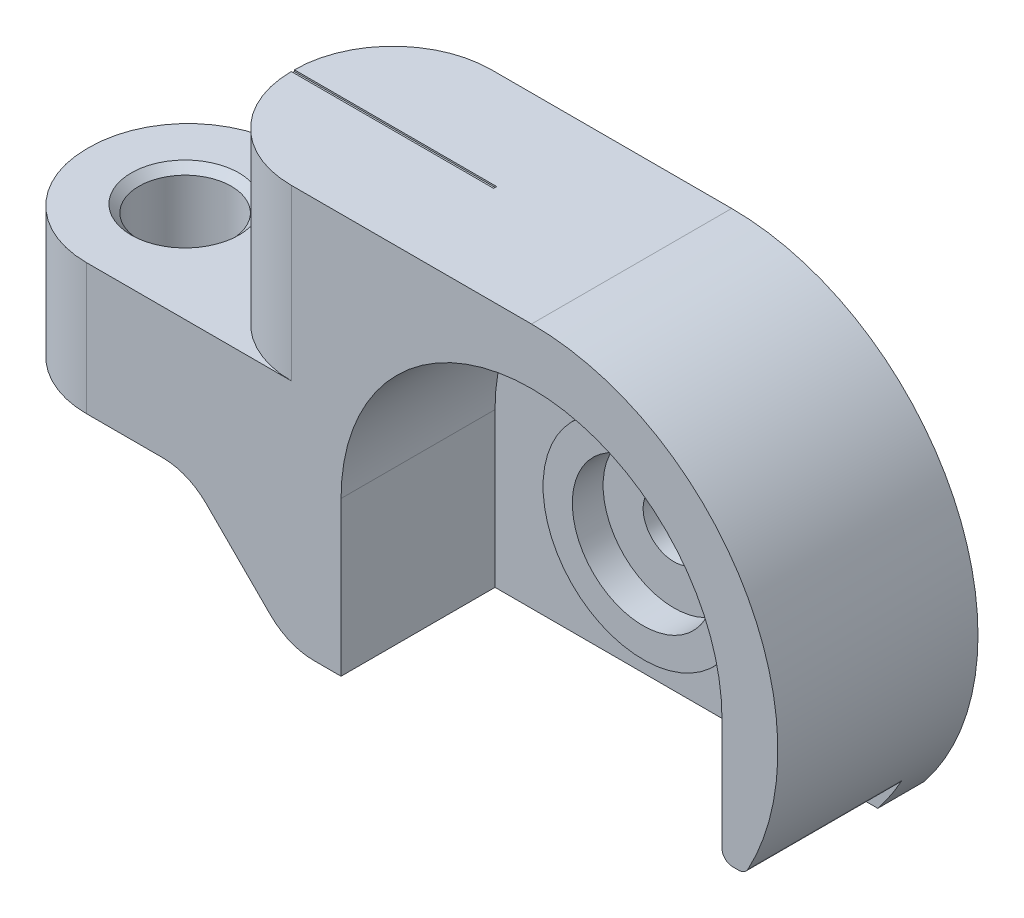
ISO-10303-21;
HEADER;
FILE_DESCRIPTION(('STEP AP214'),'2;1');
FILE_NAME('part.step','',(''),(''),'','','');
FILE_SCHEMA(('AUTOMOTIVE_DESIGN { 1 0 10303 214 1 1 1 1 }'));
ENDSEC;
DATA;
#1=APPLICATION_CONTEXT('core data for automotive mechanical design processes');
#2=APPLICATION_PROTOCOL_DEFINITION('international standard','automotive_design',2000,#1);
#3=PRODUCT_CONTEXT('',#1,'mechanical');
#4=PRODUCT('Part','Part','',(#3));
#5=PRODUCT_RELATED_PRODUCT_CATEGORY('part','',(#4));
#6=PRODUCT_DEFINITION_FORMATION('','',#4);
#7=PRODUCT_DEFINITION_CONTEXT('part definition',#1,'design');
#8=PRODUCT_DEFINITION('design','',#6,#7);
#9=PRODUCT_DEFINITION_SHAPE('','',#8);
#10=(LENGTH_UNIT() NAMED_UNIT(*) SI_UNIT(.MILLI.,.METRE.));
#11=(NAMED_UNIT(*) PLANE_ANGLE_UNIT() SI_UNIT($,.RADIAN.));
#12=(NAMED_UNIT(*) SI_UNIT($,.STERADIAN.) SOLID_ANGLE_UNIT());
#13=UNCERTAINTY_MEASURE_WITH_UNIT(LENGTH_MEASURE(1.E-05),#10,'distance_accuracy_value','');
#14=(GEOMETRIC_REPRESENTATION_CONTEXT(3) GLOBAL_UNCERTAINTY_ASSIGNED_CONTEXT((#13)) GLOBAL_UNIT_ASSIGNED_CONTEXT((#10,
#11,#12)) REPRESENTATION_CONTEXT('',''));
#15=CARTESIAN_POINT('',(0.,0.,0.));
#16=DIRECTION('',(0.,0.,1.));
#17=DIRECTION('',(1.,0.,0.));
#18=AXIS2_PLACEMENT_3D('',#15,#16,#17);
#19=CARTESIAN_POINT('',(-22.,16.,13.));
#20=DIRECTION('',(1.,0.,0.));
#21=DIRECTION('',(0.,1.,0.));
#22=AXIS2_PLACEMENT_3D('',#19,#20,#21);
#23=PLANE('',#22);
#24=DIRECTION('',(0.,0.,1.));
#25=VECTOR('',#24,1.);
#26=CARTESIAN_POINT('',(-22.,15.9,13.));
#27=LINE('',#26,#25);
#28=CARTESIAN_POINT('',(-22.,15.9,6.4));
#29=VERTEX_POINT('',#28);
#30=CARTESIAN_POINT('',(-22.,15.9,6.6));
#31=VERTEX_POINT('',#30);
#32=EDGE_CURVE('E210',#29,#31,#27,.T.);
#33=ORIENTED_EDGE('',*,*,#32,.F.);
#34=DIRECTION('',(0.,-1.,0.));
#35=VECTOR('',#34,1.);
#36=CARTESIAN_POINT('',(-22.,16.,6.4));
#37=LINE('',#36,#35);
#38=CARTESIAN_POINT('',(-22.,5.,6.4));
#39=VERTEX_POINT('',#38);
#40=EDGE_CURVE('E347',#29,#39,#37,.T.);
#41=ORIENTED_EDGE('',*,*,#40,.T.);
#42=DIRECTION('',(0.,0.,-1.));
#43=VECTOR('',#42,1.);
#44=CARTESIAN_POINT('',(-22.,5.,13.));
#45=LINE('',#44,#43);
#46=CARTESIAN_POINT('',(-22.,5.,6.6));
#47=VERTEX_POINT('',#46);
#48=EDGE_CURVE('E297',#47,#39,#45,.T.);
#49=ORIENTED_EDGE('',*,*,#48,.F.);
#50=DIRECTION('',(0.,-1.,0.));
#51=VECTOR('',#50,1.);
#52=CARTESIAN_POINT('',(-22.,16.,6.6));
#53=LINE('',#52,#51);
#54=EDGE_CURVE('E344',#47,#31,#53,.F.);
#55=ORIENTED_EDGE('',*,*,#54,.T.);
#56=EDGE_LOOP('',(#33,#41,#49,#55));
#57=FACE_BOUND('',#56,.T.);
#58=ADVANCED_FACE('F18',(#57),#23,.F.);
#59=CARTESIAN_POINT('',(-15.8,-10.,13.));
#60=DIRECTION('',(0.,1.,0.));
#61=DIRECTION('',(0.,0.,1.));
#62=AXIS2_PLACEMENT_3D('',#59,#60,#61);
#63=PLANE('',#62);
#64=DIRECTION('',(1.,0.,0.));
#65=VECTOR('',#64,1.);
#66=CARTESIAN_POINT('',(-15.8,-10.,13.));
#67=LINE('',#66,#65);
#68=CARTESIAN_POINT('',(-14.1431457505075,-10.,13.));
#69=VERTEX_POINT('',#68);
#70=CARTESIAN_POINT('',(-12.3698713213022,-10.,13.));
#71=VERTEX_POINT('',#70);
#72=EDGE_CURVE('E274',#69,#71,#67,.T.);
#73=ORIENTED_EDGE('',*,*,#72,.F.);
#74=DIRECTION('',(0.,0.,-1.));
#75=VECTOR('',#74,1.);
#76=CARTESIAN_POINT('',(-14.1431457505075,-10.,13.));
#77=LINE('',#76,#75);
#78=CARTESIAN_POINT('',(-14.1431457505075,-10.,0.));
#79=VERTEX_POINT('',#78);
#80=EDGE_CURVE('E331',#69,#79,#77,.T.);
#81=ORIENTED_EDGE('',*,*,#80,.T.);
#82=DIRECTION('',(1.,0.,0.));
#83=VECTOR('',#82,1.);
#84=CARTESIAN_POINT('',(-15.8,-10.,0.));
#85=LINE('',#84,#83);
#86=CARTESIAN_POINT('',(12.4899959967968,-10.,0.));
#87=VERTEX_POINT('',#86);
#88=EDGE_CURVE('E263',#79,#87,#85,.T.);
#89=ORIENTED_EDGE('',*,*,#88,.T.);
#90=DIRECTION('',(0.,0.,-1.));
#91=VECTOR('',#90,1.);
#92=CARTESIAN_POINT('',(12.4899959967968,-10.,13.));
#93=LINE('',#92,#91);
#94=CARTESIAN_POINT('',(12.4899959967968,-10.,3.));
#95=VERTEX_POINT('',#94);
#96=EDGE_CURVE('E276',#95,#87,#93,.T.);
#97=ORIENTED_EDGE('',*,*,#96,.F.);
#98=DIRECTION('',(1.,0.,0.));
#99=VECTOR('',#98,1.);
#100=CARTESIAN_POINT('',(-12.3698713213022,-10.,3.));
#101=LINE('',#100,#99);
#102=CARTESIAN_POINT('',(-12.3698713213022,-10.,3.));
#103=VERTEX_POINT('',#102);
#104=EDGE_CURVE('E241',#103,#95,#101,.T.);
#105=ORIENTED_EDGE('',*,*,#104,.F.);
#106=DIRECTION('',(0.,0.,1.));
#107=VECTOR('',#106,1.);
#108=CARTESIAN_POINT('',(-12.3698713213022,-10.,3.));
#109=LINE('',#108,#107);
#110=EDGE_CURVE('E256',#103,#71,#109,.T.);
#111=ORIENTED_EDGE('',*,*,#110,.T.);
#112=EDGE_LOOP('',(#73,#81,#89,#97,#105,#111));
#113=FACE_BOUND('',#112,.T.);
#114=ADVANCED_FACE('F410',(#113),#63,.F.);
#115=CARTESIAN_POINT('',(0.,0.,13.));
#116=DIRECTION('',(0.,0.,-1.));
#117=DIRECTION('',(-1.,0.,0.));
#118=AXIS2_PLACEMENT_3D('',#115,#116,#117);
#119=CYLINDRICAL_SURFACE('',#118,2.);
#120=CARTESIAN_POINT('',(0.,0.,2.5));
#121=DIRECTION('',(0.,0.,1.));
#122=DIRECTION('',(1.,0.,0.));
#123=AXIS2_PLACEMENT_3D('',#120,#121,#122);
#124=CIRCLE('',#123,2.);
#125=CARTESIAN_POINT('',(2.,0.,2.5));
#126=VERTEX_POINT('',#125);
#127=EDGE_CURVE('E11',#126,#126,#124,.F.);
#128=ORIENTED_EDGE('',*,*,#127,.T.);
#129=EDGE_LOOP('',(#128));
#130=FACE_BOUND('',#129,.T.);
#131=CARTESIAN_POINT('',(0.,0.,3.75));
#132=DIRECTION('',(0.,0.,1.));
#133=DIRECTION('',(1.,0.,0.));
#134=AXIS2_PLACEMENT_3D('',#131,#132,#133);
#135=CIRCLE('',#134,2.);
#136=CARTESIAN_POINT('',(2.,0.,3.75));
#137=VERTEX_POINT('',#136);
#138=EDGE_CURVE('E225',#137,#137,#135,.T.);
#139=ORIENTED_EDGE('',*,*,#138,.T.);
#140=EDGE_LOOP('',(#139));
#141=FACE_BOUND('',#140,.T.);
#142=ADVANCED_FACE('F417',(#130,#141),#119,.F.);
#143=CARTESIAN_POINT('',(0.,0.,13.));
#144=DIRECTION('',(0.,0.,1.));
#145=DIRECTION('',(1.,0.,0.));
#146=AXIS2_PLACEMENT_3D('',#143,#144,#145);
#147=PLANE('',#146);
#148=DIRECTION('',(-1.,0.,0.));
#149=VECTOR('',#148,1.);
#150=CARTESIAN_POINT('',(0.,16.,13.));
#151=LINE('',#150,#149);
#152=CARTESIAN_POINT('',(0.,16.,13.));
#153=VERTEX_POINT('',#152);
#154=CARTESIAN_POINT('',(-15.6,16.,13.));
#155=VERTEX_POINT('',#154);
#156=EDGE_CURVE('E262',#153,#155,#151,.T.);
#157=ORIENTED_EDGE('',*,*,#156,.T.);
#158=DIRECTION('',(0.,-1.,0.));
#159=VECTOR('',#158,1.);
#160=CARTESIAN_POINT('',(-15.6,5.,13.));
#161=LINE('',#160,#159);
#162=CARTESIAN_POINT('',(-15.6,5.,13.));
#163=VERTEX_POINT('',#162);
#164=EDGE_CURVE('E361',#155,#163,#161,.T.);
#165=ORIENTED_EDGE('',*,*,#164,.T.);
#166=DIRECTION('',(-1.,0.,0.));
#167=VECTOR('',#166,1.);
#168=CARTESIAN_POINT('',(-22.,5.,13.));
#169=LINE('',#168,#167);
#170=CARTESIAN_POINT('',(-28.9,5.,13.));
#171=VERTEX_POINT('',#170);
#172=EDGE_CURVE('E266',#163,#171,#169,.T.);
#173=ORIENTED_EDGE('',*,*,#172,.T.);
#174=DIRECTION('',(0.,-1.,0.));
#175=VECTOR('',#174,1.);
#176=CARTESIAN_POINT('',(-28.9,-3.5,13.));
#177=LINE('',#176,#175);
#178=CARTESIAN_POINT('',(-28.9,-3.5,13.));
#179=VERTEX_POINT('',#178);
#180=EDGE_CURVE('E358',#171,#179,#177,.T.);
#181=ORIENTED_EDGE('',*,*,#180,.T.);
#182=DIRECTION('',(1.,0.,0.));
#183=VECTOR('',#182,1.);
#184=CARTESIAN_POINT('',(-35.3,-3.5,13.));
#185=LINE('',#184,#183);
#186=CARTESIAN_POINT('',(-23.9568542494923,-3.5,13.));
#187=VERTEX_POINT('',#186);
#188=EDGE_CURVE('E269',#179,#187,#185,.T.);
#189=ORIENTED_EDGE('',*,*,#188,.T.);
#190=CARTESIAN_POINT('',(-23.9568542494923,-7.5,13.));
#191=DIRECTION('',(0.,0.,1.));
#192=DIRECTION('',(1.,0.,0.));
#193=AXIS2_PLACEMENT_3D('',#190,#191,#192);
#194=CIRCLE('',#193,4.);
#195=CARTESIAN_POINT('',(-21.1284271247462,-4.67157287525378,13.));
#196=VERTEX_POINT('',#195);
#197=EDGE_CURVE('E341',#187,#196,#194,.F.);
#198=ORIENTED_EDGE('',*,*,#197,.T.);
#199=DIRECTION('',(0.707106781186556,-0.707106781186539,0.));
#200=VECTOR('',#199,1.);
#201=CARTESIAN_POINT('',(-22.3,-3.5,13.));
#202=LINE('',#201,#200);
#203=CARTESIAN_POINT('',(-16.9715728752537,-8.82842712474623,13.));
#204=VERTEX_POINT('',#203);
#205=EDGE_CURVE('E271',#196,#204,#202,.T.);
#206=ORIENTED_EDGE('',*,*,#205,.T.);
#207=CARTESIAN_POINT('',(-14.1431457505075,-6.,13.));
#208=DIRECTION('',(0.,0.,1.));
#209=DIRECTION('',(1.,0.,0.));
#210=AXIS2_PLACEMENT_3D('',#207,#208,#209);
#211=CIRCLE('',#210,4.);
#212=EDGE_CURVE('E336',#204,#69,#211,.T.);
#213=ORIENTED_EDGE('',*,*,#212,.T.);
#214=ORIENTED_EDGE('',*,*,#72,.T.);
#215=DIRECTION('',(0.,-1.,0.));
#216=VECTOR('',#215,1.);
#217=CARTESIAN_POINT('',(-12.3698713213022,0.,13.));
#218=LINE('',#217,#216);
#219=CARTESIAN_POINT('',(-12.3698713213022,0.,13.));
#220=VERTEX_POINT('',#219);
#221=EDGE_CURVE('E248',#220,#71,#218,.T.);
#222=ORIENTED_EDGE('',*,*,#221,.F.);
#223=CARTESIAN_POINT('',(0.,0.,13.));
#224=DIRECTION('',(0.,0.,1.));
#225=DIRECTION('',(1.,0.,0.));
#226=AXIS2_PLACEMENT_3D('',#223,#224,#225);
#227=CIRCLE('',#226,12.3698713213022);
#228=CARTESIAN_POINT('',(12.3698713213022,0.,13.));
#229=VERTEX_POINT('',#228);
#230=EDGE_CURVE('E231',#229,#220,#227,.T.);
#231=ORIENTED_EDGE('',*,*,#230,.F.);
#232=DIRECTION('',(0.,1.,0.));
#233=VECTOR('',#232,1.);
#234=CARTESIAN_POINT('',(12.3698713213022,0.,13.));
#235=LINE('',#234,#233);
#236=CARTESIAN_POINT('',(12.3698713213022,-7.3,13.));
#237=VERTEX_POINT('',#236);
#238=EDGE_CURVE('E239',#237,#229,#235,.T.);
#239=ORIENTED_EDGE('',*,*,#238,.F.);
#240=CARTESIAN_POINT('',(13.0698713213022,-7.3,13.));
#241=DIRECTION('',(0.,0.,1.));
#242=DIRECTION('',(1.,0.,0.));
#243=AXIS2_PLACEMENT_3D('',#240,#241,#242);
#244=CIRCLE('',#243,0.7);
#245=CARTESIAN_POINT('',(13.0698713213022,-8.,13.));
#246=VERTEX_POINT('',#245);
#247=EDGE_CURVE('E312',#237,#246,#244,.T.);
#248=ORIENTED_EDGE('',*,*,#247,.T.);
#249=DIRECTION('',(-1.,0.,0.));
#250=VECTOR('',#249,1.);
#251=CARTESIAN_POINT('',(9.20101607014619,-8.,13.));
#252=LINE('',#251,#250);
#253=CARTESIAN_POINT('',(13.4461890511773,-8.,13.));
#254=VERTEX_POINT('',#253);
#255=EDGE_CURVE('E213',#254,#246,#252,.T.);
#256=ORIENTED_EDGE('',*,*,#255,.F.);
#257=CARTESIAN_POINT('',(13.4461890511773,-7.3,13.));
#258=DIRECTION('',(0.,0.,1.));
#259=DIRECTION('',(1.,0.,0.));
#260=AXIS2_PLACEMENT_3D('',#257,#258,#259);
#261=CIRCLE('',#260,0.7);
#262=CARTESIAN_POINT('',(14.0613741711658,-7.63398692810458,13.));
#263=VERTEX_POINT('',#262);
#264=EDGE_CURVE('E314',#254,#263,#261,.T.);
#265=ORIENTED_EDGE('',*,*,#264,.T.);
#266=CARTESIAN_POINT('',(0.,0.,13.));
#267=DIRECTION('',(0.,0.,1.));
#268=DIRECTION('',(1.,0.,0.));
#269=AXIS2_PLACEMENT_3D('',#266,#267,#268);
#270=CIRCLE('',#269,16.);
#271=EDGE_CURVE('E260',#263,#153,#270,.T.);
#272=ORIENTED_EDGE('',*,*,#271,.T.);
#273=EDGE_LOOP('',(#157,#165,#173,#181,#189,#198,#206,#213,#214,#222,#231,#239,#248,#256,#265,#272));
#274=FACE_BOUND('',#273,.T.);
#275=ADVANCED_FACE('F528',(#274),#147,.T.);
#276=CARTESIAN_POINT('',(0.,0.,0.));
#277=DIRECTION('',(0.,0.,1.));
#278=DIRECTION('',(1.,0.,0.));
#279=AXIS2_PLACEMENT_3D('',#276,#277,#278);
#280=PLANE('',#279);
#281=CARTESIAN_POINT('',(0.,0.,0.));
#282=DIRECTION('',(0.,0.,1.));
#283=DIRECTION('',(1.,0.,0.));
#284=AXIS2_PLACEMENT_3D('',#281,#282,#283);
#285=CIRCLE('',#284,4.5);
#286=CARTESIAN_POINT('',(4.5,0.,0.));
#287=VERTEX_POINT('',#286);
#288=EDGE_CURVE('E26',#287,#287,#285,.T.);
#289=ORIENTED_EDGE('',*,*,#288,.T.);
#290=EDGE_LOOP('',(#289));
#291=FACE_BOUND('',#290,.T.);
#292=DIRECTION('',(-1.,0.,0.));
#293=VECTOR('',#292,1.);
#294=CARTESIAN_POINT('',(-22.,5.,0.));
#295=LINE('',#294,#293);
#296=CARTESIAN_POINT('',(-15.6,5.,0.));
#297=VERTEX_POINT('',#296);
#298=CARTESIAN_POINT('',(-28.9,5.,0.));
#299=VERTEX_POINT('',#298);
#300=EDGE_CURVE('E282',#297,#299,#295,.T.);
#301=ORIENTED_EDGE('',*,*,#300,.F.);
#302=DIRECTION('',(0.,-1.,0.));
#303=VECTOR('',#302,1.);
#304=CARTESIAN_POINT('',(-15.6,0.,0.));
#305=LINE('',#304,#303);
#306=CARTESIAN_POINT('',(-15.6,16.,0.));
#307=VERTEX_POINT('',#306);
#308=EDGE_CURVE('E351',#297,#307,#305,.F.);
#309=ORIENTED_EDGE('',*,*,#308,.T.);
#310=DIRECTION('',(-1.,0.,0.));
#311=VECTOR('',#310,1.);
#312=CARTESIAN_POINT('',(0.,16.,0.));
#313=LINE('',#312,#311);
#314=CARTESIAN_POINT('',(0.,16.,0.));
#315=VERTEX_POINT('',#314);
#316=EDGE_CURVE('E279',#315,#307,#313,.T.);
#317=ORIENTED_EDGE('',*,*,#316,.F.);
#318=CARTESIAN_POINT('',(0.,0.,0.));
#319=DIRECTION('',(0.,0.,1.));
#320=DIRECTION('',(1.,0.,0.));
#321=AXIS2_PLACEMENT_3D('',#318,#319,#320);
#322=CIRCLE('',#321,16.);
#323=EDGE_CURVE('E255',#87,#315,#322,.T.);
#324=ORIENTED_EDGE('',*,*,#323,.F.);
#325=ORIENTED_EDGE('',*,*,#88,.F.);
#326=CARTESIAN_POINT('',(-14.1431457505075,-6.,0.));
#327=DIRECTION('',(0.,0.,1.));
#328=DIRECTION('',(1.,0.,0.));
#329=AXIS2_PLACEMENT_3D('',#326,#327,#328);
#330=CIRCLE('',#329,4.);
#331=CARTESIAN_POINT('',(-16.9715728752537,-8.82842712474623,0.));
#332=VERTEX_POINT('',#331);
#333=EDGE_CURVE('E334',#79,#332,#330,.F.);
#334=ORIENTED_EDGE('',*,*,#333,.T.);
#335=DIRECTION('',(0.707106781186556,-0.707106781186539,0.));
#336=VECTOR('',#335,1.);
#337=CARTESIAN_POINT('',(-22.3,-3.5,0.));
#338=LINE('',#337,#336);
#339=CARTESIAN_POINT('',(-21.1284271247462,-4.67157287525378,0.));
#340=VERTEX_POINT('',#339);
#341=EDGE_CURVE('E286',#340,#332,#338,.T.);
#342=ORIENTED_EDGE('',*,*,#341,.F.);
#343=CARTESIAN_POINT('',(-23.9568542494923,-7.5,0.));
#344=DIRECTION('',(0.,0.,1.));
#345=DIRECTION('',(1.,0.,0.));
#346=AXIS2_PLACEMENT_3D('',#343,#344,#345);
#347=CIRCLE('',#346,4.);
#348=CARTESIAN_POINT('',(-23.9568542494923,-3.5,0.));
#349=VERTEX_POINT('',#348);
#350=EDGE_CURVE('E338',#340,#349,#347,.T.);
#351=ORIENTED_EDGE('',*,*,#350,.T.);
#352=DIRECTION('',(1.,0.,0.));
#353=VECTOR('',#352,1.);
#354=CARTESIAN_POINT('',(-35.3,-3.5,0.));
#355=LINE('',#354,#353);
#356=CARTESIAN_POINT('',(-28.9,-3.5,0.));
#357=VERTEX_POINT('',#356);
#358=EDGE_CURVE('E284',#357,#349,#355,.T.);
#359=ORIENTED_EDGE('',*,*,#358,.F.);
#360=DIRECTION('',(0.,-1.,0.));
#361=VECTOR('',#360,1.);
#362=CARTESIAN_POINT('',(-28.9,0.,0.));
#363=LINE('',#362,#361);
#364=EDGE_CURVE('E349',#357,#299,#363,.F.);
#365=ORIENTED_EDGE('',*,*,#364,.T.);
#366=EDGE_LOOP('',(#301,#309,#317,#324,#325,#334,#342,#351,#359,#365));
#367=FACE_BOUND('',#366,.T.);
#368=ADVANCED_FACE('F395',(#291,#367),#280,.F.);
#369=CARTESIAN_POINT('',(0.,0.,13.));
#370=DIRECTION('',(0.,0.,-1.));
#371=DIRECTION('',(-1.,0.,0.));
#372=AXIS2_PLACEMENT_3D('',#369,#370,#371);
#373=CYLINDRICAL_SURFACE('',#372,16.);
#374=ORIENTED_EDGE('',*,*,#271,.F.);
#375=DIRECTION('',(0.,0.,-1.));
#376=VECTOR('',#375,1.);
#377=CARTESIAN_POINT('',(14.0613741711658,-7.63398692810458,13.));
#378=LINE('',#377,#376);
#379=CARTESIAN_POINT('',(14.0613741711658,-7.63398692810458,3.));
#380=VERTEX_POINT('',#379);
#381=EDGE_CURVE('E303',#263,#380,#378,.T.);
#382=ORIENTED_EDGE('',*,*,#381,.T.);
#383=CARTESIAN_POINT('',(0.,0.,3.));
#384=DIRECTION('',(0.,0.,1.));
#385=DIRECTION('',(1.,0.,0.));
#386=AXIS2_PLACEMENT_3D('',#383,#384,#385);
#387=CIRCLE('',#386,16.);
#388=EDGE_CURVE('E217',#95,#380,#387,.T.);
#389=ORIENTED_EDGE('',*,*,#388,.F.);
#390=ORIENTED_EDGE('',*,*,#96,.T.);
#391=ORIENTED_EDGE('',*,*,#323,.T.);
#392=DIRECTION('',(0.,0.,-1.));
#393=VECTOR('',#392,1.);
#394=CARTESIAN_POINT('',(0.,16.,13.));
#395=LINE('',#394,#393);
#396=EDGE_CURVE('E300',#153,#315,#395,.T.);
#397=ORIENTED_EDGE('',*,*,#396,.F.);
#398=EDGE_LOOP('',(#374,#382,#389,#390,#391,#397));
#399=FACE_BOUND('',#398,.T.);
#400=ADVANCED_FACE('F427',(#399),#373,.T.);
#401=CARTESIAN_POINT('',(0.,16.,13.));
#402=DIRECTION('',(0.,-1.,0.));
#403=DIRECTION('',(1.,0.,0.));
#404=AXIS2_PLACEMENT_3D('',#401,#402,#403);
#405=PLANE('',#404);
#406=DIRECTION('',(0.,0.,-1.));
#407=VECTOR('',#406,1.);
#408=CARTESIAN_POINT('',(-8.85759189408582,16.,6.4));
#409=LINE('',#408,#407);
#410=CARTESIAN_POINT('',(-8.85759189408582,16.,6.6));
#411=VERTEX_POINT('',#410);
#412=CARTESIAN_POINT('',(-8.85759189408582,16.,6.4));
#413=VERTEX_POINT('',#412);
#414=EDGE_CURVE('E188',#411,#413,#409,.T.);
#415=ORIENTED_EDGE('',*,*,#414,.F.);
#416=DIRECTION('',(1.,0.,0.));
#417=VECTOR('',#416,1.);
#418=CARTESIAN_POINT('',(-23.9290935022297,16.,6.6));
#419=LINE('',#418,#417);
#420=CARTESIAN_POINT('',(-22.,16.,6.6));
#421=VERTEX_POINT('',#420);
#422=EDGE_CURVE('E202',#421,#411,#419,.T.);
#423=ORIENTED_EDGE('',*,*,#422,.F.);
#424=CARTESIAN_POINT('',(-15.6,16.,6.6));
#425=DIRECTION('',(0.,-1.,0.));
#426=DIRECTION('',(1.,0.,0.));
#427=AXIS2_PLACEMENT_3D('',#424,#425,#426);
#428=CIRCLE('',#427,6.4);
#429=EDGE_CURVE('E353',#421,#155,#428,.F.);
#430=ORIENTED_EDGE('',*,*,#429,.T.);
#431=ORIENTED_EDGE('',*,*,#156,.F.);
#432=ORIENTED_EDGE('',*,*,#396,.T.);
#433=ORIENTED_EDGE('',*,*,#316,.T.);
#434=CARTESIAN_POINT('',(-15.6,16.,6.4));
#435=DIRECTION('',(0.,-1.,0.));
#436=DIRECTION('',(1.,0.,0.));
#437=AXIS2_PLACEMENT_3D('',#434,#435,#436);
#438=CIRCLE('',#437,6.4);
#439=CARTESIAN_POINT('',(-22.,16.,6.4));
#440=VERTEX_POINT('',#439);
#441=EDGE_CURVE('E355',#307,#440,#438,.F.);
#442=ORIENTED_EDGE('',*,*,#441,.T.);
#443=DIRECTION('',(-1.,0.,0.));
#444=VECTOR('',#443,1.);
#445=CARTESIAN_POINT('',(-23.9290935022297,16.,6.4));
#446=LINE('',#445,#444);
#447=EDGE_CURVE('E204',#413,#440,#446,.T.);
#448=ORIENTED_EDGE('',*,*,#447,.F.);
#449=EDGE_LOOP('',(#415,#423,#430,#431,#432,#433,#442,#448));
#450=FACE_BOUND('',#449,.T.);
#451=ADVANCED_FACE('F424',(#450),#405,.F.);
#452=CARTESIAN_POINT('',(-22.,5.,13.));
#453=DIRECTION('',(0.,-1.,0.));
#454=DIRECTION('',(1.,0.,0.));
#455=AXIS2_PLACEMENT_3D('',#452,#453,#454);
#456=PLANE('',#455);
#457=CARTESIAN_POINT('',(-29.,5.,6.5));
#458=DIRECTION('',(0.,-1.,0.));
#459=DIRECTION('',(1.,0.,0.));
#460=AXIS2_PLACEMENT_3D('',#457,#458,#459);
#461=CIRCLE('',#460,3.5);
#462=CARTESIAN_POINT('',(-25.5,5.,6.5));
#463=VERTEX_POINT('',#462);
#464=EDGE_CURVE('E390',#463,#463,#461,.T.);
#465=ORIENTED_EDGE('',*,*,#464,.T.);
#466=EDGE_LOOP('',(#465));
#467=FACE_BOUND('',#466,.T.);
#468=ORIENTED_EDGE('',*,*,#300,.T.);
#469=CARTESIAN_POINT('',(-28.9,5.,6.4));
#470=DIRECTION('',(0.,-1.,0.));
#471=DIRECTION('',(1.,0.,0.));
#472=AXIS2_PLACEMENT_3D('',#469,#470,#471);
#473=CIRCLE('',#472,6.4);
#474=CARTESIAN_POINT('',(-35.3,5.,6.4));
#475=VERTEX_POINT('',#474);
#476=EDGE_CURVE('E41',#299,#475,#473,.F.);
#477=ORIENTED_EDGE('',*,*,#476,.T.);
#478=DIRECTION('',(0.,0.,-1.));
#479=VECTOR('',#478,1.);
#480=CARTESIAN_POINT('',(-35.3,5.,13.));
#481=LINE('',#480,#479);
#482=CARTESIAN_POINT('',(-35.3,5.,6.6));
#483=VERTEX_POINT('',#482);
#484=EDGE_CURVE('E295',#483,#475,#481,.T.);
#485=ORIENTED_EDGE('',*,*,#484,.F.);
#486=CARTESIAN_POINT('',(-28.9,5.,6.6));
#487=DIRECTION('',(0.,-1.,0.));
#488=DIRECTION('',(1.,0.,0.));
#489=AXIS2_PLACEMENT_3D('',#486,#487,#488);
#490=CIRCLE('',#489,6.4);
#491=EDGE_CURVE('E373',#483,#171,#490,.F.);
#492=ORIENTED_EDGE('',*,*,#491,.T.);
#493=ORIENTED_EDGE('',*,*,#172,.F.);
#494=CARTESIAN_POINT('',(-15.6,5.,6.6));
#495=DIRECTION('',(0.,-1.,0.));
#496=DIRECTION('',(1.,0.,0.));
#497=AXIS2_PLACEMENT_3D('',#494,#495,#496);
#498=CIRCLE('',#497,6.4);
#499=EDGE_CURVE('E379',#163,#47,#498,.T.);
#500=ORIENTED_EDGE('',*,*,#499,.T.);
#501=ORIENTED_EDGE('',*,*,#48,.T.);
#502=CARTESIAN_POINT('',(-15.6,5.,6.4));
#503=DIRECTION('',(0.,-1.,0.));
#504=DIRECTION('',(1.,0.,0.));
#505=AXIS2_PLACEMENT_3D('',#502,#503,#504);
#506=CIRCLE('',#505,6.4);
#507=EDGE_CURVE('E376',#39,#297,#506,.T.);
#508=ORIENTED_EDGE('',*,*,#507,.T.);
#509=EDGE_LOOP('',(#468,#477,#485,#492,#493,#500,#501,#508));
#510=FACE_BOUND('',#509,.T.);
#511=ADVANCED_FACE('F422',(#467,#510),#456,.F.);
#512=CARTESIAN_POINT('',(-35.3,5.,13.));
#513=DIRECTION('',(1.,0.,0.));
#514=DIRECTION('',(0.,0.,-1.));
#515=AXIS2_PLACEMENT_3D('',#512,#513,#514);
#516=PLANE('',#515);
#517=ORIENTED_EDGE('',*,*,#484,.T.);
#518=DIRECTION('',(0.,-1.,0.));
#519=VECTOR('',#518,1.);
#520=CARTESIAN_POINT('',(-35.3,5.,6.4));
#521=LINE('',#520,#519);
#522=CARTESIAN_POINT('',(-35.3,-3.5,6.4));
#523=VERTEX_POINT('',#522);
#524=EDGE_CURVE('E366',#475,#523,#521,.T.);
#525=ORIENTED_EDGE('',*,*,#524,.T.);
#526=DIRECTION('',(0.,0.,-1.));
#527=VECTOR('',#526,1.);
#528=CARTESIAN_POINT('',(-35.3,-3.5,13.));
#529=LINE('',#528,#527);
#530=CARTESIAN_POINT('',(-35.3,-3.5,6.6));
#531=VERTEX_POINT('',#530);
#532=EDGE_CURVE('E292',#531,#523,#529,.T.);
#533=ORIENTED_EDGE('',*,*,#532,.F.);
#534=DIRECTION('',(0.,-1.,0.));
#535=VECTOR('',#534,1.);
#536=CARTESIAN_POINT('',(-35.3,5.,6.6));
#537=LINE('',#536,#535);
#538=EDGE_CURVE('E364',#531,#483,#537,.F.);
#539=ORIENTED_EDGE('',*,*,#538,.T.);
#540=EDGE_LOOP('',(#517,#525,#533,#539));
#541=FACE_BOUND('',#540,.T.);
#542=ADVANCED_FACE('F540',(#541),#516,.F.);
#543=CARTESIAN_POINT('',(-35.3,-3.5,13.));
#544=DIRECTION('',(0.,1.,0.));
#545=DIRECTION('',(-1.,0.,0.));
#546=AXIS2_PLACEMENT_3D('',#543,#544,#545);
#547=PLANE('',#546);
#548=CARTESIAN_POINT('',(-29.,-3.5,6.5));
#549=DIRECTION('',(0.,1.,0.));
#550=DIRECTION('',(-1.,0.,0.));
#551=AXIS2_PLACEMENT_3D('',#548,#549,#550);
#552=CIRCLE('',#551,3.5);
#553=CARTESIAN_POINT('',(-32.5,-3.5,6.5));
#554=VERTEX_POINT('',#553);
#555=EDGE_CURVE('E381',#554,#554,#552,.T.);
#556=ORIENTED_EDGE('',*,*,#555,.T.);
#557=EDGE_LOOP('',(#556));
#558=FACE_BOUND('',#557,.T.);
#559=ORIENTED_EDGE('',*,*,#532,.T.);
#560=CARTESIAN_POINT('',(-28.9,-3.5,6.4));
#561=DIRECTION('',(0.,1.,0.));
#562=DIRECTION('',(-1.,0.,0.));
#563=AXIS2_PLACEMENT_3D('',#560,#561,#562);
#564=CIRCLE('',#563,6.4);
#565=EDGE_CURVE('E371',#523,#357,#564,.F.);
#566=ORIENTED_EDGE('',*,*,#565,.T.);
#567=ORIENTED_EDGE('',*,*,#358,.T.);
#568=DIRECTION('',(0.,0.,-1.));
#569=VECTOR('',#568,1.);
#570=CARTESIAN_POINT('',(-23.9568542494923,-3.5,13.));
#571=LINE('',#570,#569);
#572=EDGE_CURVE('E328',#349,#187,#571,.F.);
#573=ORIENTED_EDGE('',*,*,#572,.T.);
#574=ORIENTED_EDGE('',*,*,#188,.F.);
#575=CARTESIAN_POINT('',(-28.9,-3.5,6.6));
#576=DIRECTION('',(0.,1.,0.));
#577=DIRECTION('',(-1.,0.,0.));
#578=AXIS2_PLACEMENT_3D('',#575,#576,#577);
#579=CIRCLE('',#578,6.4);
#580=EDGE_CURVE('E369',#179,#531,#579,.F.);
#581=ORIENTED_EDGE('',*,*,#580,.T.);
#582=EDGE_LOOP('',(#559,#566,#567,#573,#574,#581));
#583=FACE_BOUND('',#582,.T.);
#584=ADVANCED_FACE('F537',(#558,#583),#547,.F.);
#585=CARTESIAN_POINT('',(-22.3,-3.5,13.));
#586=DIRECTION('',(0.707106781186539,0.707106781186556,0.));
#587=DIRECTION('',(-0.707106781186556,0.707106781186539,0.));
#588=AXIS2_PLACEMENT_3D('',#585,#586,#587);
#589=PLANE('',#588);
#590=ORIENTED_EDGE('',*,*,#205,.F.);
#591=DIRECTION('',(0.,0.,-1.));
#592=VECTOR('',#591,1.);
#593=CARTESIAN_POINT('',(-21.1284271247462,-4.67157287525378,0.));
#594=LINE('',#593,#592);
#595=EDGE_CURVE('E325',#196,#340,#594,.T.);
#596=ORIENTED_EDGE('',*,*,#595,.T.);
#597=ORIENTED_EDGE('',*,*,#341,.T.);
#598=DIRECTION('',(0.,0.,-1.));
#599=VECTOR('',#598,1.);
#600=CARTESIAN_POINT('',(-16.9715728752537,-8.82842712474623,13.));
#601=LINE('',#600,#599);
#602=EDGE_CURVE('E323',#332,#204,#601,.F.);
#603=ORIENTED_EDGE('',*,*,#602,.T.);
#604=EDGE_LOOP('',(#590,#596,#597,#603));
#605=FACE_BOUND('',#604,.T.);
#606=ADVANCED_FACE('F524',(#605),#589,.F.);
#607=CARTESIAN_POINT('',(0.,0.,3.));
#608=DIRECTION('',(0.,0.,1.));
#609=DIRECTION('',(1.,0.,0.));
#610=AXIS2_PLACEMENT_3D('',#607,#608,#609);
#611=CYLINDRICAL_SURFACE('',#610,12.3698713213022);
#612=ORIENTED_EDGE('',*,*,#230,.T.);
#613=DIRECTION('',(0.,0.,1.));
#614=VECTOR('',#613,1.);
#615=CARTESIAN_POINT('',(-12.3698713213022,0.,3.));
#616=LINE('',#615,#614);
#617=CARTESIAN_POINT('',(-12.3698713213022,0.,3.));
#618=VERTEX_POINT('',#617);
#619=EDGE_CURVE('E245',#618,#220,#616,.T.);
#620=ORIENTED_EDGE('',*,*,#619,.F.);
#621=CARTESIAN_POINT('',(0.,0.,3.));
#622=DIRECTION('',(0.,0.,1.));
#623=DIRECTION('',(1.,0.,0.));
#624=AXIS2_PLACEMENT_3D('',#621,#622,#623);
#625=CIRCLE('',#624,12.3698713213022);
#626=CARTESIAN_POINT('',(12.3698713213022,0.,3.));
#627=VERTEX_POINT('',#626);
#628=EDGE_CURVE('E235',#627,#618,#625,.T.);
#629=ORIENTED_EDGE('',*,*,#628,.F.);
#630=DIRECTION('',(0.,0.,1.));
#631=VECTOR('',#630,1.);
#632=CARTESIAN_POINT('',(12.3698713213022,0.,3.));
#633=LINE('',#632,#631);
#634=EDGE_CURVE('E252',#627,#229,#633,.T.);
#635=ORIENTED_EDGE('',*,*,#634,.T.);
#636=EDGE_LOOP('',(#612,#620,#629,#635));
#637=FACE_BOUND('',#636,.T.);
#638=ADVANCED_FACE('F517',(#637),#611,.F.);
#639=CARTESIAN_POINT('',(12.3698713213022,0.,3.));
#640=DIRECTION('',(1.,0.,0.));
#641=DIRECTION('',(0.,0.,-1.));
#642=AXIS2_PLACEMENT_3D('',#639,#640,#641);
#643=PLANE('',#642);
#644=DIRECTION('',(0.,1.,0.));
#645=VECTOR('',#644,1.);
#646=CARTESIAN_POINT('',(12.3698713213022,0.,3.));
#647=LINE('',#646,#645);
#648=CARTESIAN_POINT('',(12.3698713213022,-7.3,3.));
#649=VERTEX_POINT('',#648);
#650=EDGE_CURVE('E243',#649,#627,#647,.T.);
#651=ORIENTED_EDGE('',*,*,#650,.F.);
#652=DIRECTION('',(0.,0.,1.));
#653=VECTOR('',#652,1.);
#654=CARTESIAN_POINT('',(12.3698713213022,-7.3,3.));
#655=LINE('',#654,#653);
#656=EDGE_CURVE('E316',#649,#237,#655,.T.);
#657=ORIENTED_EDGE('',*,*,#656,.T.);
#658=ORIENTED_EDGE('',*,*,#238,.T.);
#659=ORIENTED_EDGE('',*,*,#634,.F.);
#660=EDGE_LOOP('',(#651,#657,#658,#659));
#661=FACE_BOUND('',#660,.T.);
#662=ADVANCED_FACE('F514',(#661),#643,.F.);
#663=CARTESIAN_POINT('',(-12.3698713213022,0.,3.));
#664=DIRECTION('',(-1.,0.,0.));
#665=DIRECTION('',(0.,0.,1.));
#666=AXIS2_PLACEMENT_3D('',#663,#664,#665);
#667=PLANE('',#666);
#668=ORIENTED_EDGE('',*,*,#221,.T.);
#669=ORIENTED_EDGE('',*,*,#110,.F.);
#670=DIRECTION('',(0.,-1.,0.));
#671=VECTOR('',#670,1.);
#672=CARTESIAN_POINT('',(-12.3698713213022,0.,3.));
#673=LINE('',#672,#671);
#674=EDGE_CURVE('E238',#618,#103,#673,.T.);
#675=ORIENTED_EDGE('',*,*,#674,.F.);
#676=ORIENTED_EDGE('',*,*,#619,.T.);
#677=EDGE_LOOP('',(#668,#669,#675,#676));
#678=FACE_BOUND('',#677,.T.);
#679=ADVANCED_FACE('F512',(#678),#667,.F.);
#680=CARTESIAN_POINT('',(0.,0.,3.));
#681=DIRECTION('',(0.,0.,1.));
#682=DIRECTION('',(1.,0.,0.));
#683=AXIS2_PLACEMENT_3D('',#680,#681,#682);
#684=PLANE('',#683);
#685=ORIENTED_EDGE('',*,*,#104,.T.);
#686=ORIENTED_EDGE('',*,*,#388,.T.);
#687=CARTESIAN_POINT('',(13.4461890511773,-7.3,3.));
#688=DIRECTION('',(0.,0.,1.));
#689=DIRECTION('',(1.,0.,0.));
#690=AXIS2_PLACEMENT_3D('',#687,#688,#689);
#691=CIRCLE('',#690,0.7);
#692=CARTESIAN_POINT('',(13.4461890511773,-8.,3.));
#693=VERTEX_POINT('',#692);
#694=EDGE_CURVE('E319',#380,#693,#691,.F.);
#695=ORIENTED_EDGE('',*,*,#694,.T.);
#696=DIRECTION('',(-1.,0.,0.));
#697=VECTOR('',#696,1.);
#698=CARTESIAN_POINT('',(9.20101607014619,-8.,3.));
#699=LINE('',#698,#697);
#700=CARTESIAN_POINT('',(13.0698713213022,-8.,3.));
#701=VERTEX_POINT('',#700);
#702=EDGE_CURVE('E214',#693,#701,#699,.T.);
#703=ORIENTED_EDGE('',*,*,#702,.T.);
#704=CARTESIAN_POINT('',(13.0698713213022,-7.3,3.));
#705=DIRECTION('',(0.,0.,1.));
#706=DIRECTION('',(1.,0.,0.));
#707=AXIS2_PLACEMENT_3D('',#704,#705,#706);
#708=CIRCLE('',#707,0.7);
#709=EDGE_CURVE('E321',#701,#649,#708,.F.);
#710=ORIENTED_EDGE('',*,*,#709,.T.);
#711=ORIENTED_EDGE('',*,*,#650,.T.);
#712=ORIENTED_EDGE('',*,*,#628,.T.);
#713=ORIENTED_EDGE('',*,*,#674,.T.);
#714=EDGE_LOOP('',(#685,#686,#695,#703,#710,#711,#712,#713));
#715=FACE_BOUND('',#714,.T.);
#716=CARTESIAN_POINT('',(0.,0.,3.));
#717=DIRECTION('',(0.,0.,1.));
#718=DIRECTION('',(1.,0.,0.));
#719=AXIS2_PLACEMENT_3D('',#716,#717,#718);
#720=CIRCLE('',#719,6.5);
#721=CARTESIAN_POINT('',(6.5,0.,3.));
#722=VERTEX_POINT('',#721);
#723=EDGE_CURVE('E232',#722,#722,#720,.T.);
#724=ORIENTED_EDGE('',*,*,#723,.F.);
#725=EDGE_LOOP('',(#724));
#726=FACE_BOUND('',#725,.T.);
#727=ADVANCED_FACE('F505',(#715,#726),#684,.T.);
#728=CARTESIAN_POINT('',(0.,0.,5.75));
#729=DIRECTION('',(0.,0.,1.));
#730=DIRECTION('',(1.,0.,0.));
#731=AXIS2_PLACEMENT_3D('',#728,#729,#730);
#732=PLANE('',#731);
#733=CARTESIAN_POINT('',(0.,0.,5.75));
#734=DIRECTION('',(0.,0.,1.));
#735=DIRECTION('',(1.,0.,0.));
#736=AXIS2_PLACEMENT_3D('',#733,#734,#735);
#737=CIRCLE('',#736,4.6);
#738=CARTESIAN_POINT('',(4.6,0.,5.75));
#739=VERTEX_POINT('',#738);
#740=EDGE_CURVE('E221',#739,#739,#737,.T.);
#741=ORIENTED_EDGE('',*,*,#740,.F.);
#742=EDGE_LOOP('',(#741));
#743=FACE_BOUND('',#742,.T.);
#744=CARTESIAN_POINT('',(0.,0.,5.75));
#745=DIRECTION('',(0.,0.,1.));
#746=DIRECTION('',(1.,0.,0.));
#747=AXIS2_PLACEMENT_3D('',#744,#745,#746);
#748=CIRCLE('',#747,6.5);
#749=CARTESIAN_POINT('',(6.5,0.,5.75));
#750=VERTEX_POINT('',#749);
#751=EDGE_CURVE('E228',#750,#750,#748,.T.);
#752=ORIENTED_EDGE('',*,*,#751,.T.);
#753=EDGE_LOOP('',(#752));
#754=FACE_BOUND('',#753,.T.);
#755=ADVANCED_FACE('F502',(#743,#754),#732,.T.);
#756=CARTESIAN_POINT('',(0.,0.,5.75));
#757=DIRECTION('',(0.,0.,-1.));
#758=DIRECTION('',(-1.,0.,0.));
#759=AXIS2_PLACEMENT_3D('',#756,#757,#758);
#760=CYLINDRICAL_SURFACE('',#759,6.5);
#761=ORIENTED_EDGE('',*,*,#751,.F.);
#762=EDGE_LOOP('',(#761));
#763=FACE_BOUND('',#762,.T.);
#764=ORIENTED_EDGE('',*,*,#723,.T.);
#765=EDGE_LOOP('',(#764));
#766=FACE_BOUND('',#765,.T.);
#767=ADVANCED_FACE('F500',(#763,#766),#760,.T.);
#768=CARTESIAN_POINT('',(0.,0.,3.75));
#769=DIRECTION('',(0.,0.,1.));
#770=DIRECTION('',(1.,0.,0.));
#771=AXIS2_PLACEMENT_3D('',#768,#769,#770);
#772=CYLINDRICAL_SURFACE('',#771,4.6);
#773=CARTESIAN_POINT('',(0.,0.,3.75));
#774=DIRECTION('',(0.,0.,1.));
#775=DIRECTION('',(1.,0.,0.));
#776=AXIS2_PLACEMENT_3D('',#773,#774,#775);
#777=CIRCLE('',#776,4.6);
#778=CARTESIAN_POINT('',(4.6,0.,3.75));
#779=VERTEX_POINT('',#778);
#780=EDGE_CURVE('E222',#779,#779,#777,.T.);
#781=ORIENTED_EDGE('',*,*,#780,.F.);
#782=EDGE_LOOP('',(#781));
#783=FACE_BOUND('',#782,.T.);
#784=ORIENTED_EDGE('',*,*,#740,.T.);
#785=EDGE_LOOP('',(#784));
#786=FACE_BOUND('',#785,.T.);
#787=ADVANCED_FACE('F496',(#783,#786),#772,.F.);
#788=CARTESIAN_POINT('',(0.,0.,3.75));
#789=DIRECTION('',(0.,0.,1.));
#790=DIRECTION('',(1.,0.,0.));
#791=AXIS2_PLACEMENT_3D('',#788,#789,#790);
#792=PLANE('',#791);
#793=ORIENTED_EDGE('',*,*,#138,.F.);
#794=EDGE_LOOP('',(#793));
#795=FACE_BOUND('',#794,.T.);
#796=ORIENTED_EDGE('',*,*,#780,.T.);
#797=EDGE_LOOP('',(#796));
#798=FACE_BOUND('',#797,.T.);
#799=ADVANCED_FACE('F492',(#795,#798),#792,.T.);
#800=CARTESIAN_POINT('',(9.20101607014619,-8.,3.));
#801=DIRECTION('',(0.,1.,0.));
#802=DIRECTION('',(0.,0.,1.));
#803=AXIS2_PLACEMENT_3D('',#800,#801,#802);
#804=PLANE('',#803);
#805=ORIENTED_EDGE('',*,*,#702,.F.);
#806=DIRECTION('',(0.,0.,-1.));
#807=VECTOR('',#806,1.);
#808=CARTESIAN_POINT('',(13.4461890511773,-8.,3.));
#809=LINE('',#808,#807);
#810=EDGE_CURVE('E310',#693,#254,#809,.F.);
#811=ORIENTED_EDGE('',*,*,#810,.T.);
#812=ORIENTED_EDGE('',*,*,#255,.T.);
#813=DIRECTION('',(0.,0.,1.));
#814=VECTOR('',#813,1.);
#815=CARTESIAN_POINT('',(13.0698713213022,-8.,3.));
#816=LINE('',#815,#814);
#817=EDGE_CURVE('E308',#246,#701,#816,.F.);
#818=ORIENTED_EDGE('',*,*,#817,.T.);
#819=EDGE_LOOP('',(#805,#811,#812,#818));
#820=FACE_BOUND('',#819,.T.);
#821=ADVANCED_FACE('F436',(#820),#804,.F.);
#822=CARTESIAN_POINT('',(13.4461890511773,-7.3,13.));
#823=DIRECTION('',(0.,0.,-1.));
#824=DIRECTION('',(-1.,0.,0.));
#825=AXIS2_PLACEMENT_3D('',#822,#823,#824);
#826=CYLINDRICAL_SURFACE('',#825,0.7);
#827=ORIENTED_EDGE('',*,*,#264,.F.);
#828=ORIENTED_EDGE('',*,*,#810,.F.);
#829=ORIENTED_EDGE('',*,*,#694,.F.);
#830=ORIENTED_EDGE('',*,*,#381,.F.);
#831=EDGE_LOOP('',(#827,#828,#829,#830));
#832=FACE_BOUND('',#831,.T.);
#833=ADVANCED_FACE('F432',(#832),#826,.T.);
#834=CARTESIAN_POINT('',(13.0698713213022,-7.3,3.));
#835=DIRECTION('',(0.,0.,1.));
#836=DIRECTION('',(1.,0.,0.));
#837=AXIS2_PLACEMENT_3D('',#834,#835,#836);
#838=CYLINDRICAL_SURFACE('',#837,0.7);
#839=ORIENTED_EDGE('',*,*,#709,.F.);
#840=ORIENTED_EDGE('',*,*,#817,.F.);
#841=ORIENTED_EDGE('',*,*,#247,.F.);
#842=ORIENTED_EDGE('',*,*,#656,.F.);
#843=EDGE_LOOP('',(#839,#840,#841,#842));
#844=FACE_BOUND('',#843,.T.);
#845=ADVANCED_FACE('F435',(#844),#838,.T.);
#846=CARTESIAN_POINT('',(-23.9568542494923,-7.5,13.));
#847=DIRECTION('',(0.,0.,1.));
#848=DIRECTION('',(1.,0.,0.));
#849=AXIS2_PLACEMENT_3D('',#846,#847,#848);
#850=CYLINDRICAL_SURFACE('',#849,4.);
#851=ORIENTED_EDGE('',*,*,#197,.F.);
#852=ORIENTED_EDGE('',*,*,#572,.F.);
#853=ORIENTED_EDGE('',*,*,#350,.F.);
#854=ORIENTED_EDGE('',*,*,#595,.F.);
#855=EDGE_LOOP('',(#851,#852,#853,#854));
#856=FACE_BOUND('',#855,.T.);
#857=ADVANCED_FACE('F440',(#856),#850,.F.);
#858=CARTESIAN_POINT('',(-14.1431457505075,-6.,13.));
#859=DIRECTION('',(0.,0.,-1.));
#860=DIRECTION('',(-1.,0.,0.));
#861=AXIS2_PLACEMENT_3D('',#858,#859,#860);
#862=CYLINDRICAL_SURFACE('',#861,4.);
#863=ORIENTED_EDGE('',*,*,#212,.F.);
#864=ORIENTED_EDGE('',*,*,#602,.F.);
#865=ORIENTED_EDGE('',*,*,#333,.F.);
#866=ORIENTED_EDGE('',*,*,#80,.F.);
#867=EDGE_LOOP('',(#863,#864,#865,#866));
#868=FACE_BOUND('',#867,.T.);
#869=ADVANCED_FACE('F444',(#868),#862,.T.);
#870=CARTESIAN_POINT('',(-15.6,16.,6.4));
#871=DIRECTION('',(0.,-1.,0.));
#872=DIRECTION('',(1.,0.,0.));
#873=AXIS2_PLACEMENT_3D('',#870,#871,#872);
#874=CYLINDRICAL_SURFACE('',#873,6.4);
#875=ORIENTED_EDGE('',*,*,#441,.F.);
#876=ORIENTED_EDGE('',*,*,#308,.F.);
#877=ORIENTED_EDGE('',*,*,#507,.F.);
#878=ORIENTED_EDGE('',*,*,#40,.F.);
#879=EDGE_CURVE('E197',#440,#29,#37,.T.);
#880=ORIENTED_EDGE('',*,*,#879,.F.);
#881=EDGE_LOOP('',(#875,#876,#877,#878,#880));
#882=FACE_BOUND('',#881,.T.);
#883=ADVANCED_FACE('F448',(#882),#874,.T.);
#884=CARTESIAN_POINT('',(-15.6,0.,6.6));
#885=DIRECTION('',(0.,1.,0.));
#886=DIRECTION('',(-1.,0.,0.));
#887=AXIS2_PLACEMENT_3D('',#884,#885,#886);
#888=CYLINDRICAL_SURFACE('',#887,6.4);
#889=ORIENTED_EDGE('',*,*,#429,.F.);
#890=EDGE_CURVE('E343',#31,#421,#53,.F.);
#891=ORIENTED_EDGE('',*,*,#890,.F.);
#892=ORIENTED_EDGE('',*,*,#54,.F.);
#893=ORIENTED_EDGE('',*,*,#499,.F.);
#894=ORIENTED_EDGE('',*,*,#164,.F.);
#895=EDGE_LOOP('',(#889,#891,#892,#893,#894));
#896=FACE_BOUND('',#895,.T.);
#897=ADVANCED_FACE('F452',(#896),#888,.T.);
#898=CARTESIAN_POINT('',(-28.9,5.,6.4));
#899=DIRECTION('',(0.,-1.,0.));
#900=DIRECTION('',(0.,0.,-1.));
#901=AXIS2_PLACEMENT_3D('',#898,#899,#900);
#902=CYLINDRICAL_SURFACE('',#901,6.4);
#903=ORIENTED_EDGE('',*,*,#476,.F.);
#904=ORIENTED_EDGE('',*,*,#364,.F.);
#905=ORIENTED_EDGE('',*,*,#565,.F.);
#906=ORIENTED_EDGE('',*,*,#524,.F.);
#907=EDGE_LOOP('',(#903,#904,#905,#906));
#908=FACE_BOUND('',#907,.T.);
#909=ADVANCED_FACE('F456',(#908),#902,.T.);
#910=CARTESIAN_POINT('',(-28.9,0.,6.6));
#911=DIRECTION('',(0.,1.,0.));
#912=DIRECTION('',(0.,0.,1.));
#913=AXIS2_PLACEMENT_3D('',#910,#911,#912);
#914=CYLINDRICAL_SURFACE('',#913,6.4);
#915=ORIENTED_EDGE('',*,*,#491,.F.);
#916=ORIENTED_EDGE('',*,*,#538,.F.);
#917=ORIENTED_EDGE('',*,*,#580,.F.);
#918=ORIENTED_EDGE('',*,*,#180,.F.);
#919=EDGE_LOOP('',(#915,#916,#917,#918));
#920=FACE_BOUND('',#919,.T.);
#921=ADVANCED_FACE('F460',(#920),#914,.T.);
#922=CARTESIAN_POINT('',(-29.,-5.,6.5));
#923=DIRECTION('',(0.,1.,0.));
#924=DIRECTION('',(-1.,0.,0.));
#925=AXIS2_PLACEMENT_3D('',#922,#923,#924);
#926=CYLINDRICAL_SURFACE('',#925,3.);
#927=CARTESIAN_POINT('',(-29.,-3.,6.5));
#928=DIRECTION('',(0.,1.,0.));
#929=DIRECTION('',(0.,0.,1.));
#930=AXIS2_PLACEMENT_3D('',#927,#928,#929);
#931=CIRCLE('',#930,3.);
#932=CARTESIAN_POINT('',(-29.,-3.,9.5));
#933=VERTEX_POINT('',#932);
#934=EDGE_CURVE('E387',#933,#933,#931,.F.);
#935=ORIENTED_EDGE('',*,*,#934,.T.);
#936=EDGE_LOOP('',(#935));
#937=FACE_BOUND('',#936,.T.);
#938=CARTESIAN_POINT('',(-29.,4.5,6.5));
#939=DIRECTION('',(0.,-1.,0.));
#940=DIRECTION('',(0.,0.,-1.));
#941=AXIS2_PLACEMENT_3D('',#938,#939,#940);
#942=CIRCLE('',#941,3.);
#943=CARTESIAN_POINT('',(-29.,4.5,3.5));
#944=VERTEX_POINT('',#943);
#945=EDGE_CURVE('E384',#944,#944,#942,.F.);
#946=ORIENTED_EDGE('',*,*,#945,.T.);
#947=EDGE_LOOP('',(#946));
#948=FACE_BOUND('',#947,.T.);
#949=ADVANCED_FACE('F464',(#937,#948),#926,.F.);
#950=CARTESIAN_POINT('',(-29.,-3.5,6.5));
#951=DIRECTION('',(0.,-1.,0.));
#952=DIRECTION('',(0.,0.,-1.));
#953=AXIS2_PLACEMENT_3D('',#950,#951,#952);
#954=CONICAL_SURFACE('',#953,3.5,0.785398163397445);
#955=ORIENTED_EDGE('',*,*,#934,.F.);
#956=EDGE_LOOP('',(#955));
#957=FACE_BOUND('',#956,.T.);
#958=ORIENTED_EDGE('',*,*,#555,.F.);
#959=EDGE_LOOP('',(#958));
#960=FACE_BOUND('',#959,.T.);
#961=ADVANCED_FACE('F466',(#957,#960),#954,.F.);
#962=CARTESIAN_POINT('',(-29.,4.5,6.5));
#963=DIRECTION('',(0.,1.,0.));
#964=DIRECTION('',(0.,0.,1.));
#965=AXIS2_PLACEMENT_3D('',#962,#963,#964);
#966=CONICAL_SURFACE('',#965,3.,0.78539816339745);
#967=ORIENTED_EDGE('',*,*,#464,.F.);
#968=EDGE_LOOP('',(#967));
#969=FACE_BOUND('',#968,.T.);
#970=ORIENTED_EDGE('',*,*,#945,.F.);
#971=EDGE_LOOP('',(#970));
#972=FACE_BOUND('',#971,.T.);
#973=ADVANCED_FACE('F468',(#969,#972),#966,.F.);
#974=CARTESIAN_POINT('',(0.,15.9,0.));
#975=DIRECTION('',(0.,1.,0.));
#976=DIRECTION('',(-1.,0.,0.));
#977=AXIS2_PLACEMENT_3D('',#974,#975,#976);
#978=PLANE('',#977);
#979=ORIENTED_EDGE('',*,*,#32,.T.);
#980=DIRECTION('',(1.,0.,0.));
#981=VECTOR('',#980,1.);
#982=CARTESIAN_POINT('',(-23.9290935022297,15.9,6.6));
#983=LINE('',#982,#981);
#984=CARTESIAN_POINT('',(-8.85759189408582,15.9,6.6));
#985=VERTEX_POINT('',#984);
#986=EDGE_CURVE('E33',#31,#985,#983,.T.);
#987=ORIENTED_EDGE('',*,*,#986,.T.);
#988=DIRECTION('',(0.,0.,-1.));
#989=VECTOR('',#988,1.);
#990=CARTESIAN_POINT('',(-8.85759189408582,15.9,6.4));
#991=LINE('',#990,#989);
#992=CARTESIAN_POINT('',(-8.85759189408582,15.9,6.4));
#993=VERTEX_POINT('',#992);
#994=EDGE_CURVE('E186',#985,#993,#991,.T.);
#995=ORIENTED_EDGE('',*,*,#994,.T.);
#996=DIRECTION('',(-1.,0.,0.));
#997=VECTOR('',#996,1.);
#998=CARTESIAN_POINT('',(-23.9290935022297,15.9,6.4));
#999=LINE('',#998,#997);
#1000=EDGE_CURVE('E194',#993,#29,#999,.T.);
#1001=ORIENTED_EDGE('',*,*,#1000,.T.);
#1002=EDGE_LOOP('',(#979,#987,#995,#1001));
#1003=FACE_BOUND('',#1002,.T.);
#1004=ADVANCED_FACE('F201',(#1003),#978,.T.);
#1005=CARTESIAN_POINT('',(-8.85759189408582,15.9,6.4));
#1006=DIRECTION('',(1.,0.,0.));
#1007=DIRECTION('',(0.,1.,0.));
#1008=AXIS2_PLACEMENT_3D('',#1005,#1006,#1007);
#1009=PLANE('',#1008);
#1010=ORIENTED_EDGE('',*,*,#414,.T.);
#1011=DIRECTION('',(0.,1.,0.));
#1012=VECTOR('',#1011,1.);
#1013=CARTESIAN_POINT('',(-8.85759189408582,15.9,6.4));
#1014=LINE('',#1013,#1012);
#1015=EDGE_CURVE('E181',#993,#413,#1014,.T.);
#1016=ORIENTED_EDGE('',*,*,#1015,.F.);
#1017=ORIENTED_EDGE('',*,*,#994,.F.);
#1018=DIRECTION('',(0.,1.,0.));
#1019=VECTOR('',#1018,1.);
#1020=CARTESIAN_POINT('',(-8.85759189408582,15.9,6.6));
#1021=LINE('',#1020,#1019);
#1022=EDGE_CURVE('E191',#985,#411,#1021,.T.);
#1023=ORIENTED_EDGE('',*,*,#1022,.T.);
#1024=EDGE_LOOP('',(#1010,#1016,#1017,#1023));
#1025=FACE_BOUND('',#1024,.T.);
#1026=ADVANCED_FACE('F183',(#1025),#1009,.F.);
#1027=CARTESIAN_POINT('',(-23.9290935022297,15.9,6.6));
#1028=DIRECTION('',(0.,0.,1.));
#1029=DIRECTION('',(1.,0.,0.));
#1030=AXIS2_PLACEMENT_3D('',#1027,#1028,#1029);
#1031=PLANE('',#1030);
#1032=ORIENTED_EDGE('',*,*,#890,.T.);
#1033=ORIENTED_EDGE('',*,*,#422,.T.);
#1034=ORIENTED_EDGE('',*,*,#1022,.F.);
#1035=ORIENTED_EDGE('',*,*,#986,.F.);
#1036=EDGE_LOOP('',(#1032,#1033,#1034,#1035));
#1037=FACE_BOUND('',#1036,.T.);
#1038=ADVANCED_FACE('F406',(#1037),#1031,.F.);
#1039=CARTESIAN_POINT('',(-23.9290935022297,15.9,6.4));
#1040=DIRECTION('',(0.,0.,-1.));
#1041=DIRECTION('',(-1.,0.,0.));
#1042=AXIS2_PLACEMENT_3D('',#1039,#1040,#1041);
#1043=PLANE('',#1042);
#1044=ORIENTED_EDGE('',*,*,#879,.T.);
#1045=ORIENTED_EDGE('',*,*,#1000,.F.);
#1046=ORIENTED_EDGE('',*,*,#1015,.T.);
#1047=ORIENTED_EDGE('',*,*,#447,.T.);
#1048=EDGE_LOOP('',(#1044,#1045,#1046,#1047));
#1049=FACE_BOUND('',#1048,.T.);
#1050=ADVANCED_FACE('F195',(#1049),#1043,.F.);
#1051=CARTESIAN_POINT('',(0.,0.,0.));
#1052=DIRECTION('',(0.,0.,-1.));
#1053=DIRECTION('',(-1.,0.,0.));
#1054=AXIS2_PLACEMENT_3D('',#1051,#1052,#1053);
#1055=CONICAL_SURFACE('',#1054,4.5,0.785398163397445);
#1056=ORIENTED_EDGE('',*,*,#127,.F.);
#1057=EDGE_LOOP('',(#1056));
#1058=FACE_BOUND('',#1057,.T.);
#1059=ORIENTED_EDGE('',*,*,#288,.F.);
#1060=EDGE_LOOP('',(#1059));
#1061=FACE_BOUND('',#1060,.T.);
#1062=ADVANCED_FACE('F20',(#1058,#1061),#1055,.F.);
#1063=CLOSED_SHELL('',(#58,#114,#142,#275,#368,#400,#451,#511,#542,#584,#606,#638,#662,#679,
#727,#755,#767,#787,#799,#821,#833,#845,#857,#869,#883,#897,#909,#921,#949,#961,#973,#1004,
#1026,#1038,#1050,#1062));
#1064=MANIFOLD_SOLID_BREP('B1',#1063);
#1065=ADVANCED_BREP_SHAPE_REPRESENTATION('',(#18,#1064),#14);
#1066=SHAPE_DEFINITION_REPRESENTATION(#9,#1065);
ENDSEC;
END-ISO-10303-21;
